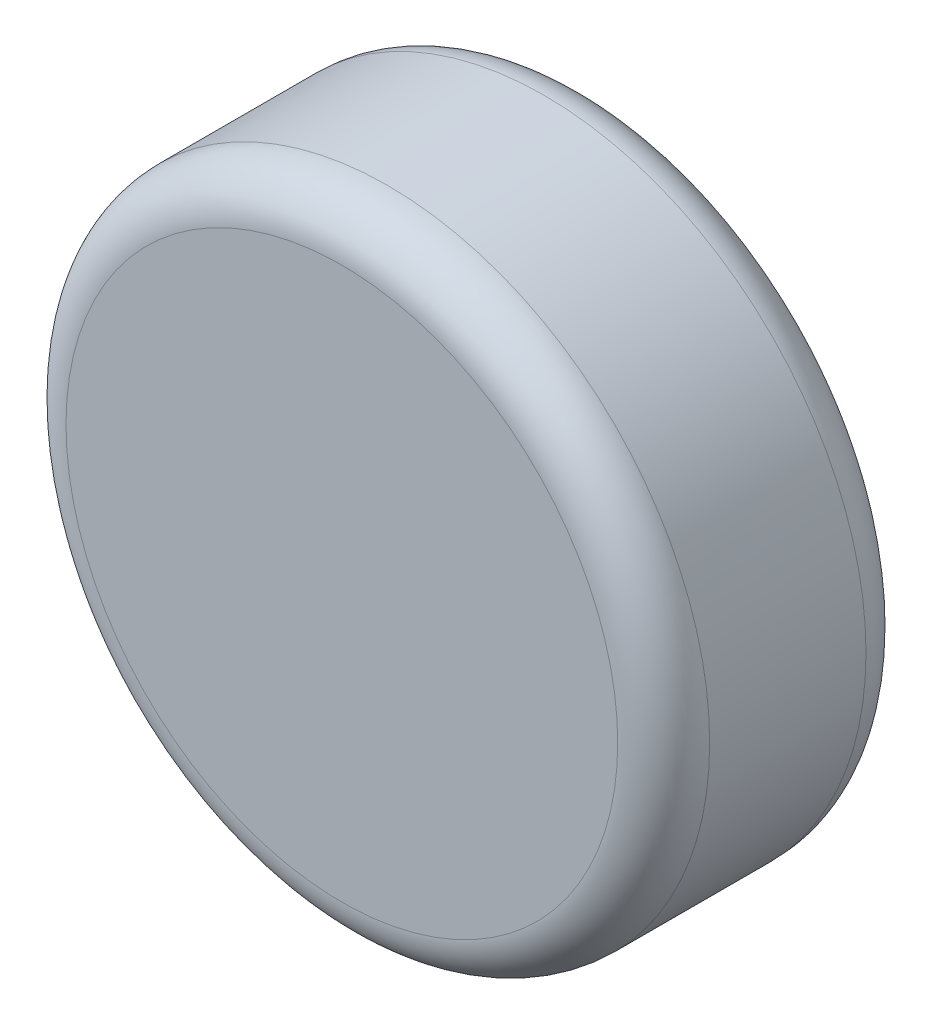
ISO-10303-21;
HEADER;
FILE_DESCRIPTION(('STEP AP214'),'2;1');
FILE_NAME('part.step','',(''),(''),'','','');
FILE_SCHEMA(('AUTOMOTIVE_DESIGN { 1 0 10303 214 1 1 1 1 }'));
ENDSEC;
DATA;
#1=APPLICATION_CONTEXT('core data for automotive mechanical design processes');
#2=APPLICATION_PROTOCOL_DEFINITION('international standard','automotive_design',2000,#1);
#3=PRODUCT_CONTEXT('',#1,'mechanical');
#4=PRODUCT('Part','Part','',(#3));
#5=PRODUCT_RELATED_PRODUCT_CATEGORY('part','',(#4));
#6=PRODUCT_DEFINITION_FORMATION('','',#4);
#7=PRODUCT_DEFINITION_CONTEXT('part definition',#1,'design');
#8=PRODUCT_DEFINITION('design','',#6,#7);
#9=PRODUCT_DEFINITION_SHAPE('','',#8);
#10=(LENGTH_UNIT() NAMED_UNIT(*) SI_UNIT(.MILLI.,.METRE.));
#11=(NAMED_UNIT(*) PLANE_ANGLE_UNIT() SI_UNIT($,.RADIAN.));
#12=(NAMED_UNIT(*) SI_UNIT($,.STERADIAN.) SOLID_ANGLE_UNIT());
#13=UNCERTAINTY_MEASURE_WITH_UNIT(LENGTH_MEASURE(1.E-05),#10,'distance_accuracy_value','');
#14=(GEOMETRIC_REPRESENTATION_CONTEXT(3) GLOBAL_UNCERTAINTY_ASSIGNED_CONTEXT((#13)) GLOBAL_UNIT_ASSIGNED_CONTEXT((#10,
#11,#12)) REPRESENTATION_CONTEXT('',''));
#15=CARTESIAN_POINT('',(0.,0.,0.));
#16=DIRECTION('',(0.,0.,1.));
#17=DIRECTION('',(1.,0.,0.));
#18=AXIS2_PLACEMENT_3D('',#15,#16,#17);
#19=CARTESIAN_POINT('',(0.,0.,0.));
#20=DIRECTION('',(0.,0.,1.));
#21=DIRECTION('',(1.,0.,0.));
#22=AXIS2_PLACEMENT_3D('',#19,#20,#21);
#23=PLANE('',#22);
#24=CARTESIAN_POINT('',(0.,0.,0.));
#25=DIRECTION('',(0.,0.,1.));
#26=DIRECTION('',(1.,0.,0.));
#27=AXIS2_PLACEMENT_3D('',#24,#25,#26);
#28=CIRCLE('',#27,30.);
#29=CARTESIAN_POINT('',(30.,0.,0.));
#30=VERTEX_POINT('',#29);
#31=EDGE_CURVE('E41',#30,#30,#28,.F.);
#32=ORIENTED_EDGE('',*,*,#31,.T.);
#33=EDGE_LOOP('',(#32));
#34=FACE_BOUND('',#33,.T.);
#35=CARTESIAN_POINT('',(0.,0.,0.));
#36=DIRECTION('',(0.,0.,1.));
#37=DIRECTION('',(1.,0.,0.));
#38=AXIS2_PLACEMENT_3D('',#35,#36,#37);
#39=CIRCLE('',#38,7.);
#40=CARTESIAN_POINT('',(7.,0.,0.));
#41=VERTEX_POINT('',#40);
#42=EDGE_CURVE('E113',#41,#41,#39,.F.);
#43=ORIENTED_EDGE('',*,*,#42,.F.);
#44=EDGE_LOOP('',(#43));
#45=FACE_BOUND('',#44,.T.);
#46=ADVANCED_FACE('F33',(#34,#45),#23,.F.);
#47=CARTESIAN_POINT('',(0.,0.,27.));
#48=DIRECTION('',(0.,0.,-1.));
#49=DIRECTION('',(-1.,0.,0.));
#50=AXIS2_PLACEMENT_3D('',#47,#48,#49);
#51=CYLINDRICAL_SURFACE('',#50,35.);
#52=CARTESIAN_POINT('',(0.,0.,5.));
#53=DIRECTION('',(0.,0.,1.));
#54=DIRECTION('',(1.,0.,0.));
#55=AXIS2_PLACEMENT_3D('',#52,#53,#54);
#56=CIRCLE('',#55,35.);
#57=CARTESIAN_POINT('',(35.,0.,5.));
#58=VERTEX_POINT('',#57);
#59=EDGE_CURVE('E119',#58,#58,#56,.T.);
#60=ORIENTED_EDGE('',*,*,#59,.T.);
#61=EDGE_LOOP('',(#60));
#62=FACE_BOUND('',#61,.T.);
#63=CARTESIAN_POINT('',(0.,0.,22.));
#64=DIRECTION('',(0.,0.,1.));
#65=DIRECTION('',(1.,0.,0.));
#66=AXIS2_PLACEMENT_3D('',#63,#64,#65);
#67=CIRCLE('',#66,35.);
#68=CARTESIAN_POINT('',(35.,0.,22.));
#69=VERTEX_POINT('',#68);
#70=EDGE_CURVE('E116',#69,#69,#67,.F.);
#71=ORIENTED_EDGE('',*,*,#70,.T.);
#72=EDGE_LOOP('',(#71));
#73=FACE_BOUND('',#72,.T.);
#74=ADVANCED_FACE('F132',(#62,#73),#51,.T.);
#75=CARTESIAN_POINT('',(0.,0.,27.));
#76=DIRECTION('',(0.,0.,1.));
#77=DIRECTION('',(1.,0.,0.));
#78=AXIS2_PLACEMENT_3D('',#75,#76,#77);
#79=PLANE('',#78);
#80=CARTESIAN_POINT('',(0.,0.,27.));
#81=DIRECTION('',(0.,0.,1.));
#82=DIRECTION('',(1.,0.,0.));
#83=AXIS2_PLACEMENT_3D('',#80,#81,#82);
#84=CIRCLE('',#83,30.);
#85=CARTESIAN_POINT('',(30.,0.,27.));
#86=VERTEX_POINT('',#85);
#87=EDGE_CURVE('E11',#86,#86,#84,.T.);
#88=ORIENTED_EDGE('',*,*,#87,.T.);
#89=EDGE_LOOP('',(#88));
#90=FACE_BOUND('',#89,.T.);
#91=ADVANCED_FACE('F135',(#90),#79,.T.);
#92=CARTESIAN_POINT('',(0.,0.,-4.));
#93=DIRECTION('',(0.,0.,-1.));
#94=DIRECTION('',(-1.,0.,0.));
#95=AXIS2_PLACEMENT_3D('',#92,#93,#94);
#96=PLANE('',#95);
#97=CARTESIAN_POINT('',(0.,0.,-4.));
#98=DIRECTION('',(0.,0.,-1.));
#99=DIRECTION('',(-1.,0.,0.));
#100=AXIS2_PLACEMENT_3D('',#97,#98,#99);
#101=CIRCLE('',#100,7.);
#102=CARTESIAN_POINT('',(-7.,0.,-4.));
#103=VERTEX_POINT('',#102);
#104=EDGE_CURVE('E89',#103,#103,#101,.T.);
#105=ORIENTED_EDGE('',*,*,#104,.T.);
#106=EDGE_LOOP('',(#105));
#107=FACE_BOUND('',#106,.T.);
#108=DIRECTION('',(-0.707106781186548,-0.707106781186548,0.));
#109=VECTOR('',#108,1.);
#110=CARTESIAN_POINT('',(2.,0.,-4.));
#111=LINE('',#110,#109);
#112=CARTESIAN_POINT('',(2.,0.,-4.));
#113=VERTEX_POINT('',#112);
#114=CARTESIAN_POINT('',(0.,-2.,-4.));
#115=VERTEX_POINT('',#114);
#116=EDGE_CURVE('E81',#113,#115,#111,.T.);
#117=ORIENTED_EDGE('',*,*,#116,.F.);
#118=CARTESIAN_POINT('',(0.,0.,-4.));
#119=DIRECTION('',(0.,0.,-1.));
#120=DIRECTION('',(1.,0.,0.));
#121=AXIS2_PLACEMENT_3D('',#118,#119,#120);
#122=CIRCLE('',#121,2.);
#123=CARTESIAN_POINT('',(0.,2.,-4.));
#124=VERTEX_POINT('',#123);
#125=EDGE_CURVE('E73',#124,#113,#122,.T.);
#126=ORIENTED_EDGE('',*,*,#125,.F.);
#127=DIRECTION('',(0.707106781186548,0.707106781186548,0.));
#128=VECTOR('',#127,1.);
#129=CARTESIAN_POINT('',(0.,2.,-4.));
#130=LINE('',#129,#128);
#131=CARTESIAN_POINT('',(-2.,0.,-4.));
#132=VERTEX_POINT('',#131);
#133=EDGE_CURVE('E96',#132,#124,#130,.T.);
#134=ORIENTED_EDGE('',*,*,#133,.F.);
#135=CARTESIAN_POINT('',(0.,0.,-4.));
#136=DIRECTION('',(0.,0.,-1.));
#137=DIRECTION('',(1.,0.,0.));
#138=AXIS2_PLACEMENT_3D('',#135,#136,#137);
#139=CIRCLE('',#138,2.);
#140=EDGE_CURVE('E94',#115,#132,#139,.T.);
#141=ORIENTED_EDGE('',*,*,#140,.F.);
#142=EDGE_LOOP('',(#117,#126,#134,#141));
#143=FACE_BOUND('',#142,.T.);
#144=ADVANCED_FACE('F93',(#107,#143),#96,.T.);
#145=CARTESIAN_POINT('',(0.,0.,-4.));
#146=DIRECTION('',(0.,0.,1.));
#147=DIRECTION('',(1.,0.,0.));
#148=AXIS2_PLACEMENT_3D('',#145,#146,#147);
#149=CYLINDRICAL_SURFACE('',#148,7.);
#150=ORIENTED_EDGE('',*,*,#104,.F.);
#151=EDGE_LOOP('',(#150));
#152=FACE_BOUND('',#151,.T.);
#153=ORIENTED_EDGE('',*,*,#42,.T.);
#154=EDGE_LOOP('',(#153));
#155=FACE_BOUND('',#154,.T.);
#156=ADVANCED_FACE('F148',(#152,#155),#149,.T.);
#157=CARTESIAN_POINT('',(0.,0.,-4.));
#158=DIRECTION('',(0.,0.,1.));
#159=DIRECTION('',(1.,0.,0.));
#160=AXIS2_PLACEMENT_3D('',#157,#158,#159);
#161=CYLINDRICAL_SURFACE('',#160,2.);
#162=CARTESIAN_POINT('',(0.,0.,0.));
#163=DIRECTION('',(0.,0.,-1.));
#164=DIRECTION('',(1.,0.,0.));
#165=AXIS2_PLACEMENT_3D('',#162,#163,#164);
#166=CIRCLE('',#165,2.);
#167=CARTESIAN_POINT('',(0.,2.,0.));
#168=VERTEX_POINT('',#167);
#169=CARTESIAN_POINT('',(2.,0.,0.));
#170=VERTEX_POINT('',#169);
#171=EDGE_CURVE('E100',#168,#170,#166,.T.);
#172=ORIENTED_EDGE('',*,*,#171,.F.);
#173=DIRECTION('',(0.,0.,1.));
#174=VECTOR('',#173,1.);
#175=CARTESIAN_POINT('',(0.,2.,-4.));
#176=LINE('',#175,#174);
#177=EDGE_CURVE('E48',#124,#168,#176,.T.);
#178=ORIENTED_EDGE('',*,*,#177,.F.);
#179=ORIENTED_EDGE('',*,*,#125,.T.);
#180=DIRECTION('',(0.,0.,1.));
#181=VECTOR('',#180,1.);
#182=CARTESIAN_POINT('',(2.,0.,-4.));
#183=LINE('',#182,#181);
#184=EDGE_CURVE('E76',#113,#170,#183,.T.);
#185=ORIENTED_EDGE('',*,*,#184,.T.);
#186=EDGE_LOOP('',(#172,#178,#179,#185));
#187=FACE_BOUND('',#186,.T.);
#188=ADVANCED_FACE('F75',(#187),#161,.F.);
#189=CARTESIAN_POINT('',(2.,0.,-4.));
#190=DIRECTION('',(-0.707106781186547,0.707106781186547,0.));
#191=DIRECTION('',(-0.707106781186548,-0.707106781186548,0.));
#192=AXIS2_PLACEMENT_3D('',#189,#190,#191);
#193=PLANE('',#192);
#194=DIRECTION('',(-0.707106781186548,-0.707106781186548,0.));
#195=VECTOR('',#194,1.);
#196=CARTESIAN_POINT('',(2.,0.,0.));
#197=LINE('',#196,#195);
#198=CARTESIAN_POINT('',(0.,-2.,0.));
#199=VERTEX_POINT('',#198);
#200=EDGE_CURVE('E88',#170,#199,#197,.T.);
#201=ORIENTED_EDGE('',*,*,#200,.F.);
#202=ORIENTED_EDGE('',*,*,#184,.F.);
#203=ORIENTED_EDGE('',*,*,#116,.T.);
#204=DIRECTION('',(0.,0.,1.));
#205=VECTOR('',#204,1.);
#206=CARTESIAN_POINT('',(0.,-2.,-4.));
#207=LINE('',#206,#205);
#208=EDGE_CURVE('E90',#115,#199,#207,.T.);
#209=ORIENTED_EDGE('',*,*,#208,.T.);
#210=EDGE_LOOP('',(#201,#202,#203,#209));
#211=FACE_BOUND('',#210,.T.);
#212=ADVANCED_FACE('F85',(#211),#193,.T.);
#213=CARTESIAN_POINT('',(0.,0.,-4.));
#214=DIRECTION('',(0.,0.,1.));
#215=DIRECTION('',(1.,0.,0.));
#216=AXIS2_PLACEMENT_3D('',#213,#214,#215);
#217=CYLINDRICAL_SURFACE('',#216,2.);
#218=CARTESIAN_POINT('',(0.,0.,0.));
#219=DIRECTION('',(0.,0.,-1.));
#220=DIRECTION('',(1.,0.,0.));
#221=AXIS2_PLACEMENT_3D('',#218,#219,#220);
#222=CIRCLE('',#221,2.);
#223=CARTESIAN_POINT('',(-2.,0.,0.));
#224=VERTEX_POINT('',#223);
#225=EDGE_CURVE('E103',#199,#224,#222,.T.);
#226=ORIENTED_EDGE('',*,*,#225,.F.);
#227=ORIENTED_EDGE('',*,*,#208,.F.);
#228=ORIENTED_EDGE('',*,*,#140,.T.);
#229=DIRECTION('',(0.,0.,1.));
#230=VECTOR('',#229,1.);
#231=CARTESIAN_POINT('',(-2.,0.,-4.));
#232=LINE('',#231,#230);
#233=EDGE_CURVE('E53',#132,#224,#232,.T.);
#234=ORIENTED_EDGE('',*,*,#233,.T.);
#235=EDGE_LOOP('',(#226,#227,#228,#234));
#236=FACE_BOUND('',#235,.T.);
#237=ADVANCED_FACE('F162',(#236),#217,.F.);
#238=CARTESIAN_POINT('',(0.,2.,-4.));
#239=DIRECTION('',(0.707106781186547,-0.707106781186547,0.));
#240=DIRECTION('',(0.707106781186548,0.707106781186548,0.));
#241=AXIS2_PLACEMENT_3D('',#238,#239,#240);
#242=PLANE('',#241);
#243=DIRECTION('',(0.707106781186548,0.707106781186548,0.));
#244=VECTOR('',#243,1.);
#245=CARTESIAN_POINT('',(0.,2.,0.));
#246=LINE('',#245,#244);
#247=EDGE_CURVE('E82',#224,#168,#246,.T.);
#248=ORIENTED_EDGE('',*,*,#247,.F.);
#249=ORIENTED_EDGE('',*,*,#233,.F.);
#250=ORIENTED_EDGE('',*,*,#133,.T.);
#251=ORIENTED_EDGE('',*,*,#177,.T.);
#252=EDGE_LOOP('',(#248,#249,#250,#251));
#253=FACE_BOUND('',#252,.T.);
#254=ADVANCED_FACE('F157',(#253),#242,.T.);
#255=ORIENTED_EDGE('',*,*,#247,.T.);
#256=ORIENTED_EDGE('',*,*,#171,.T.);
#257=ORIENTED_EDGE('',*,*,#200,.T.);
#258=ORIENTED_EDGE('',*,*,#225,.T.);
#259=EDGE_LOOP('',(#255,#256,#257,#258));
#260=FACE_BOUND('',#259,.T.);
#261=ADVANCED_FACE('F129',(#260),#23,.F.);
#262=CARTESIAN_POINT('',(0.,0.,5.));
#263=DIRECTION('',(0.,0.,1.));
#264=DIRECTION('',(1.,0.,0.));
#265=AXIS2_PLACEMENT_3D('',#262,#263,#264);
#266=TOROIDAL_SURFACE('',#265,30.,5.);
#267=ORIENTED_EDGE('',*,*,#31,.F.);
#268=EDGE_LOOP('',(#267));
#269=FACE_BOUND('',#268,.T.);
#270=ORIENTED_EDGE('',*,*,#59,.F.);
#271=EDGE_LOOP('',(#270));
#272=FACE_BOUND('',#271,.T.);
#273=ADVANCED_FACE('F126',(#269,#272),#266,.T.);
#274=CARTESIAN_POINT('',(0.,0.,22.));
#275=DIRECTION('',(0.,0.,1.));
#276=DIRECTION('',(1.,0.,0.));
#277=AXIS2_PLACEMENT_3D('',#274,#275,#276);
#278=TOROIDAL_SURFACE('',#277,30.,5.);
#279=ORIENTED_EDGE('',*,*,#70,.F.);
#280=EDGE_LOOP('',(#279));
#281=FACE_BOUND('',#280,.T.);
#282=ORIENTED_EDGE('',*,*,#87,.F.);
#283=EDGE_LOOP('',(#282));
#284=FACE_BOUND('',#283,.T.);
#285=ADVANCED_FACE('F35',(#281,#284),#278,.T.);
#286=CLOSED_SHELL('',(#46,#74,#91,#144,#156,#188,#212,#237,#254,#261,#273,#285));
#287=MANIFOLD_SOLID_BREP('B2',#286);
#288=ADVANCED_BREP_SHAPE_REPRESENTATION('',(#18,#287),#14);
#289=SHAPE_DEFINITION_REPRESENTATION(#9,#288);
ENDSEC;
END-ISO-10303-21;
